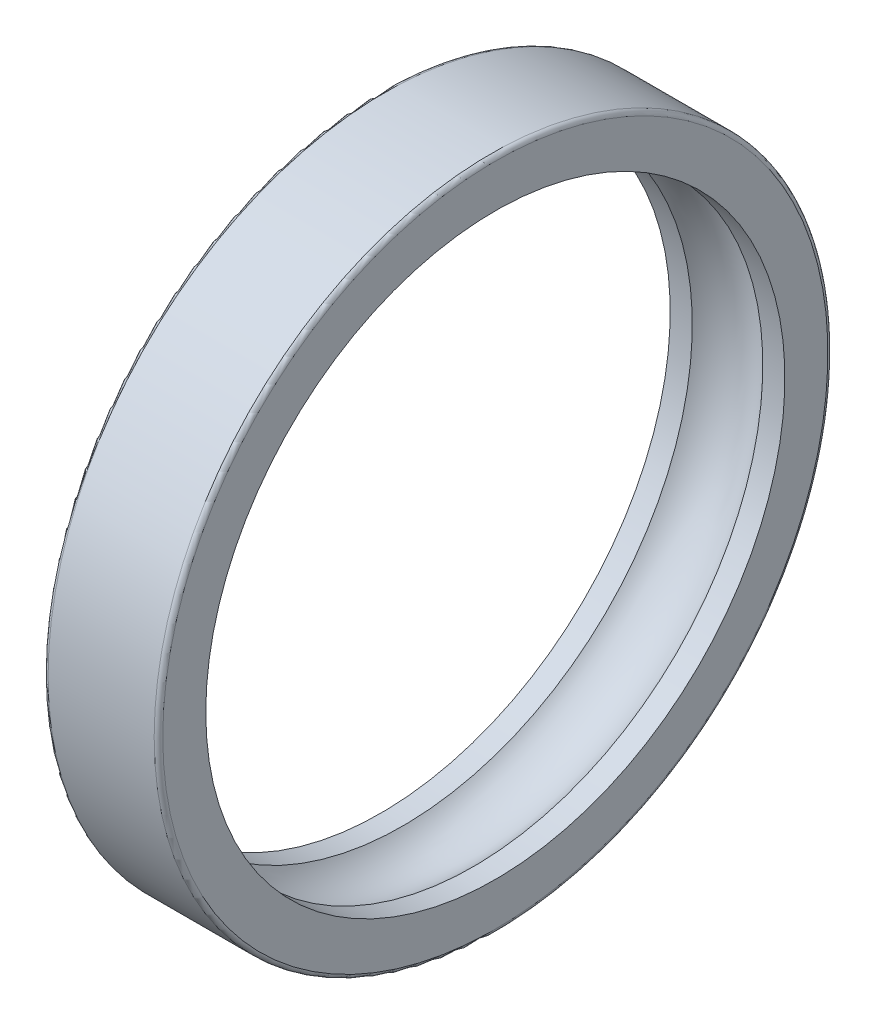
ISO-10303-21;
HEADER;
FILE_DESCRIPTION(('STEP AP214'),'2;1');
FILE_NAME('part.step','',(''),(''),'','','');
FILE_SCHEMA(('AUTOMOTIVE_DESIGN { 1 0 10303 214 1 1 1 1 }'));
ENDSEC;
DATA;
#1=APPLICATION_CONTEXT('core data for automotive mechanical design processes');
#2=APPLICATION_PROTOCOL_DEFINITION('international standard','automotive_design',2000,#1);
#3=PRODUCT_CONTEXT('',#1,'mechanical');
#4=PRODUCT('Part','Part','',(#3));
#5=PRODUCT_RELATED_PRODUCT_CATEGORY('part','',(#4));
#6=PRODUCT_DEFINITION_FORMATION('','',#4);
#7=PRODUCT_DEFINITION_CONTEXT('part definition',#1,'design');
#8=PRODUCT_DEFINITION('design','',#6,#7);
#9=PRODUCT_DEFINITION_SHAPE('','',#8);
#10=(LENGTH_UNIT() NAMED_UNIT(*) SI_UNIT(.MILLI.,.METRE.));
#11=(NAMED_UNIT(*) PLANE_ANGLE_UNIT() SI_UNIT($,.RADIAN.));
#12=(NAMED_UNIT(*) SI_UNIT($,.STERADIAN.) SOLID_ANGLE_UNIT());
#13=UNCERTAINTY_MEASURE_WITH_UNIT(LENGTH_MEASURE(1.E-05),#10,'distance_accuracy_value','');
#14=(GEOMETRIC_REPRESENTATION_CONTEXT(3) GLOBAL_UNCERTAINTY_ASSIGNED_CONTEXT((#13)) GLOBAL_UNIT_ASSIGNED_CONTEXT((#10,
#11,#12)) REPRESENTATION_CONTEXT('',''));
#15=CARTESIAN_POINT('',(0.,0.,0.));
#16=DIRECTION('',(0.,0.,1.));
#17=DIRECTION('',(1.,0.,0.));
#18=AXIS2_PLACEMENT_3D('',#15,#16,#17);
#19=CARTESIAN_POINT('',(0.299999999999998,0.,0.));
#20=DIRECTION('',(-1.,0.,0.));
#21=DIRECTION('',(0.,0.,1.));
#22=AXIS2_PLACEMENT_3D('',#19,#20,#21);
#23=TOROIDAL_SURFACE('',#22,23.2,0.300000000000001);
#24=CARTESIAN_POINT('',(0.,0.,0.));
#25=DIRECTION('',(-1.,0.,0.));
#26=DIRECTION('',(0.,0.,1.));
#27=AXIS2_PLACEMENT_3D('',#24,#25,#26);
#28=CIRCLE('',#27,23.2);
#29=CARTESIAN_POINT('',(0.,0.,23.2));
#30=VERTEX_POINT('',#29);
#31=EDGE_CURVE('E10',#30,#30,#28,.T.);
#32=ORIENTED_EDGE('',*,*,#31,.F.);
#33=EDGE_LOOP('',(#32));
#34=FACE_BOUND('',#33,.T.);
#35=CARTESIAN_POINT('',(0.300000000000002,0.,0.));
#36=DIRECTION('',(-1.,0.,0.));
#37=DIRECTION('',(0.,0.,1.));
#38=AXIS2_PLACEMENT_3D('',#35,#36,#37);
#39=CIRCLE('',#38,23.5);
#40=CARTESIAN_POINT('',(0.300000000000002,0.,23.5));
#41=VERTEX_POINT('',#40);
#42=EDGE_CURVE('E57',#41,#41,#39,.T.);
#43=ORIENTED_EDGE('',*,*,#42,.T.);
#44=EDGE_LOOP('',(#43));
#45=FACE_BOUND('',#44,.T.);
#46=ADVANCED_FACE('F29',(#34,#45),#23,.T.);
#47=CARTESIAN_POINT('',(0.,0.,-23.2));
#48=DIRECTION('',(1.,0.,0.));
#49=DIRECTION('',(0.,0.,-1.));
#50=AXIS2_PLACEMENT_3D('',#47,#48,#49);
#51=PLANE('',#50);
#52=CARTESIAN_POINT('',(0.,0.,0.));
#53=DIRECTION('',(-1.,0.,0.));
#54=DIRECTION('',(0.,0.,1.));
#55=AXIS2_PLACEMENT_3D('',#52,#53,#54);
#56=CIRCLE('',#55,20.2);
#57=CARTESIAN_POINT('',(0.,0.,20.2));
#58=VERTEX_POINT('',#57);
#59=EDGE_CURVE('E35',#58,#58,#56,.T.);
#60=ORIENTED_EDGE('',*,*,#59,.F.);
#61=EDGE_LOOP('',(#60));
#62=FACE_BOUND('',#61,.T.);
#63=ORIENTED_EDGE('',*,*,#31,.T.);
#64=EDGE_LOOP('',(#63));
#65=FACE_BOUND('',#64,.T.);
#66=ADVANCED_FACE('F94',(#62,#65),#51,.F.);
#67=CARTESIAN_POINT('',(0.,0.,0.));
#68=DIRECTION('',(-1.,0.,0.));
#69=DIRECTION('',(0.,0.,1.));
#70=AXIS2_PLACEMENT_3D('',#67,#68,#69);
#71=CYLINDRICAL_SURFACE('',#70,20.2);
#72=CARTESIAN_POINT('',(1.54032522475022,0.,0.));
#73=DIRECTION('',(-1.,0.,0.));
#74=DIRECTION('',(0.,0.,1.));
#75=AXIS2_PLACEMENT_3D('',#72,#73,#74);
#76=CIRCLE('',#75,20.2);
#77=CARTESIAN_POINT('',(1.54032522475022,0.,20.2));
#78=VERTEX_POINT('',#77);
#79=EDGE_CURVE('E39',#78,#78,#76,.T.);
#80=ORIENTED_EDGE('',*,*,#79,.F.);
#81=EDGE_LOOP('',(#80));
#82=FACE_BOUND('',#81,.T.);
#83=ORIENTED_EDGE('',*,*,#59,.T.);
#84=EDGE_LOOP('',(#83));
#85=FACE_BOUND('',#84,.T.);
#86=ADVANCED_FACE('F89',(#82,#85),#71,.F.);
#87=CARTESIAN_POINT('',(4.,0.,0.));
#88=DIRECTION('',(-1.,0.,0.));
#89=DIRECTION('',(0.,0.,1.));
#90=AXIS2_PLACEMENT_3D('',#87,#88,#89);
#91=TOROIDAL_SURFACE('',#90,18.,3.3);
#92=CARTESIAN_POINT('',(6.45967477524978,0.,0.));
#93=DIRECTION('',(-1.,0.,0.));
#94=DIRECTION('',(0.,0.,1.));
#95=AXIS2_PLACEMENT_3D('',#92,#93,#94);
#96=CIRCLE('',#95,20.2);
#97=CARTESIAN_POINT('',(6.45967477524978,0.,20.2));
#98=VERTEX_POINT('',#97);
#99=EDGE_CURVE('E43',#98,#98,#96,.T.);
#100=ORIENTED_EDGE('',*,*,#99,.F.);
#101=EDGE_LOOP('',(#100));
#102=FACE_BOUND('',#101,.T.);
#103=ORIENTED_EDGE('',*,*,#79,.T.);
#104=EDGE_LOOP('',(#103));
#105=FACE_BOUND('',#104,.T.);
#106=ADVANCED_FACE('F83',(#102,#105),#91,.F.);
#107=CARTESIAN_POINT('',(0.,0.,0.));
#108=DIRECTION('',(-1.,0.,0.));
#109=DIRECTION('',(0.,0.,1.));
#110=AXIS2_PLACEMENT_3D('',#107,#108,#109);
#111=CYLINDRICAL_SURFACE('',#110,20.2);
#112=CARTESIAN_POINT('',(8.,0.,0.));
#113=DIRECTION('',(-1.,0.,0.));
#114=DIRECTION('',(0.,0.,1.));
#115=AXIS2_PLACEMENT_3D('',#112,#113,#114);
#116=CIRCLE('',#115,20.2);
#117=CARTESIAN_POINT('',(8.,0.,20.2));
#118=VERTEX_POINT('',#117);
#119=EDGE_CURVE('E48',#118,#118,#116,.T.);
#120=ORIENTED_EDGE('',*,*,#119,.F.);
#121=EDGE_LOOP('',(#120));
#122=FACE_BOUND('',#121,.T.);
#123=ORIENTED_EDGE('',*,*,#99,.T.);
#124=EDGE_LOOP('',(#123));
#125=FACE_BOUND('',#124,.T.);
#126=ADVANCED_FACE('F77',(#122,#125),#111,.F.);
#127=CARTESIAN_POINT('',(8.,0.,-23.2));
#128=DIRECTION('',(-1.,0.,0.));
#129=DIRECTION('',(0.,0.,1.));
#130=AXIS2_PLACEMENT_3D('',#127,#128,#129);
#131=PLANE('',#130);
#132=CARTESIAN_POINT('',(8.,0.,0.));
#133=DIRECTION('',(-1.,0.,0.));
#134=DIRECTION('',(0.,0.,1.));
#135=AXIS2_PLACEMENT_3D('',#132,#133,#134);
#136=CIRCLE('',#135,23.2);
#137=CARTESIAN_POINT('',(8.,0.,23.2));
#138=VERTEX_POINT('',#137);
#139=EDGE_CURVE('E51',#138,#138,#136,.T.);
#140=ORIENTED_EDGE('',*,*,#139,.F.);
#141=EDGE_LOOP('',(#140));
#142=FACE_BOUND('',#141,.T.);
#143=ORIENTED_EDGE('',*,*,#119,.T.);
#144=EDGE_LOOP('',(#143));
#145=FACE_BOUND('',#144,.T.);
#146=ADVANCED_FACE('F71',(#142,#145),#131,.F.);
#147=CARTESIAN_POINT('',(7.7,0.,0.));
#148=DIRECTION('',(-1.,0.,0.));
#149=DIRECTION('',(0.,0.,1.));
#150=AXIS2_PLACEMENT_3D('',#147,#148,#149);
#151=TOROIDAL_SURFACE('',#150,23.2,0.300000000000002);
#152=CARTESIAN_POINT('',(7.7,0.,0.));
#153=DIRECTION('',(-1.,0.,0.));
#154=DIRECTION('',(0.,0.,1.));
#155=AXIS2_PLACEMENT_3D('',#152,#153,#154);
#156=CIRCLE('',#155,23.5);
#157=CARTESIAN_POINT('',(7.7,0.,23.5));
#158=VERTEX_POINT('',#157);
#159=EDGE_CURVE('E54',#158,#158,#156,.T.);
#160=ORIENTED_EDGE('',*,*,#159,.F.);
#161=EDGE_LOOP('',(#160));
#162=FACE_BOUND('',#161,.T.);
#163=ORIENTED_EDGE('',*,*,#139,.T.);
#164=EDGE_LOOP('',(#163));
#165=FACE_BOUND('',#164,.T.);
#166=ADVANCED_FACE('F65',(#162,#165),#151,.T.);
#167=CARTESIAN_POINT('',(0.,0.,0.));
#168=DIRECTION('',(-1.,0.,0.));
#169=DIRECTION('',(0.,0.,1.));
#170=AXIS2_PLACEMENT_3D('',#167,#168,#169);
#171=CYLINDRICAL_SURFACE('',#170,23.5);
#172=ORIENTED_EDGE('',*,*,#42,.F.);
#173=EDGE_LOOP('',(#172));
#174=FACE_BOUND('',#173,.T.);
#175=ORIENTED_EDGE('',*,*,#159,.T.);
#176=EDGE_LOOP('',(#175));
#177=FACE_BOUND('',#176,.T.);
#178=ADVANCED_FACE('F62',(#174,#177),#171,.T.);
#179=CLOSED_SHELL('',(#46,#66,#86,#106,#126,#146,#166,#178));
#180=MANIFOLD_SOLID_BREP('B2',#179);
#181=ADVANCED_BREP_SHAPE_REPRESENTATION('',(#18,#180),#14);
#182=SHAPE_DEFINITION_REPRESENTATION(#9,#181);
ENDSEC;
END-ISO-10303-21;
